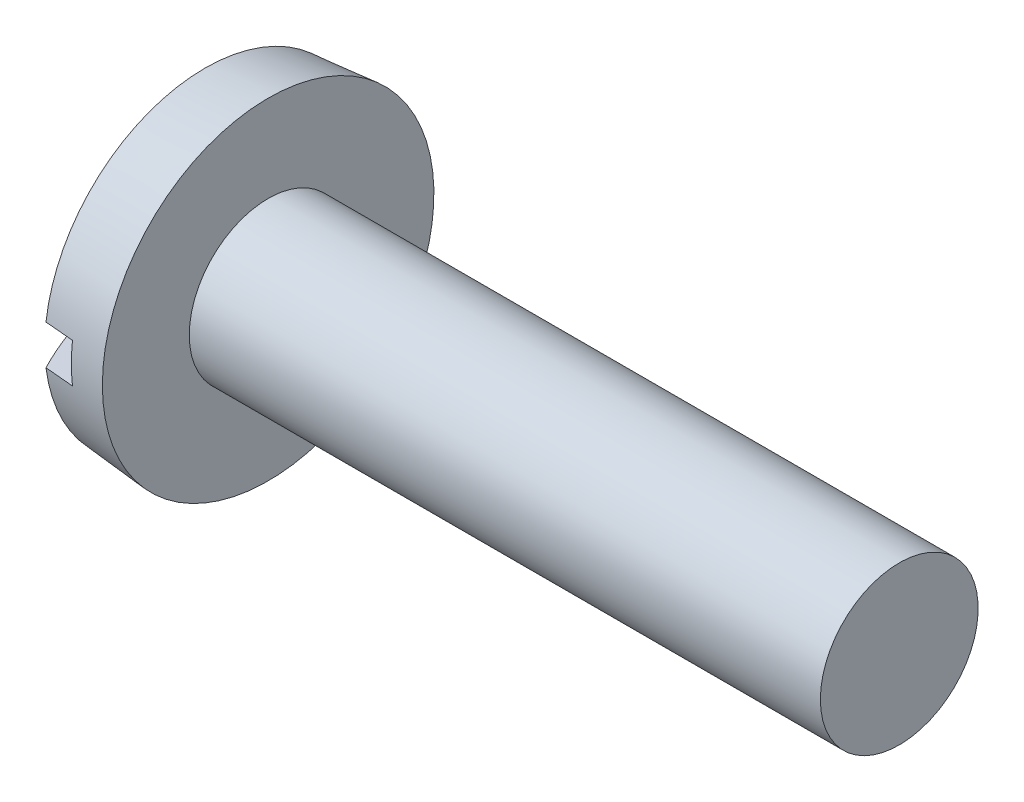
from build123d import *

# Parameters (mm, degrees)
SKETCH2_W         = 20.0152
SKETCH2_H         = 2.3876
SLOT_DEPTH        = 4.1402
CIRPATTERN1_COUNT = 2
CIRPATTERN1_ANGLE = 90


with BuildPart() as part:
    # BodySke → Base-Revolve (revolve)
    with BuildSketch(Plane.XY, mode=Mode.PRIVATE) as base_revolve_sk:
        with BuildLine():
            Line((6.1976, 4.7625), (6.1976, 10.0076))
            Line((6.1976, 10.0076), (2.3876, 9.674268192))
            ThreePointArc((2.3876, 9.674268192), (0.605722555, 4.982271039), (0, 0))
            Line((0, 0), (44.2976, 0))
            Line((44.2976, 0), (44.2976, 4.7625))
            Line((44.2976, 4.7625), (6.1976, 4.7625))
        make_face()
    revolve(base_revolve_sk.sketch.rotate(Axis((-25.4, 0, 0), (1, 0, 0)), 90), axis=Axis((-25.4, 0, 0), (1, 0, 0)))

    # Sketch2 → Slot (cut)
    with BuildSketch(Plane(origin=(0, 0, 0), x_dir=(0, 0, -1), z_dir=(1, 0, 0))):
        Rectangle(SKETCH2_W, SKETCH2_H)
    extrude(amount=SLOT_DEPTH, mode=Mode.SUBTRACT)

    # Sketch3 → Cross section 0
    with BuildSketch(Plane(origin=(0, 0, 0), x_dir=(0, 0, -1), z_dir=(1, 0, 0))):
        with BuildLine():
            Line((-1.0287, 6.096), (1.0287, 6.096))
            Line((1.0287, 6.096), (1.0287, -6.096))
            Line((1.0287, -6.096), (-1.0287, -6.096))
            Line((-1.0287, -6.096), (-1.0287, 6.096))
        make_face()
    # Sketch4 → Cross section 1
    with BuildSketch(Plane(origin=(7.2644, 0, 0), x_dir=(0, 0, -1), z_dir=(1, 0, 0))):
        with BuildLine():
            Line((-0.51435, 0.51435), (0.51435, 0.51435))
            Line((0.51435, 0.51435), (0.51435, -0.51435))
            Line((0.51435, -0.51435), (-0.51435, -0.51435))
            Line((-0.51435, -0.51435), (-0.51435, 0.51435))
        make_face()
    cross = loft(mode=Mode.SUBTRACT)

    # CirPattern1: Cross ×2 about axis
    cirpattern1_axis = Axis((0, 0, 0), (1, 0, 0))
    for i in range(1, CIRPATTERN1_COUNT):
        add(cross.rotate(cirpattern1_axis, i * CIRPATTERN1_ANGLE / (CIRPATTERN1_COUNT - 1)), mode=Mode.SUBTRACT)


solid = part.part
